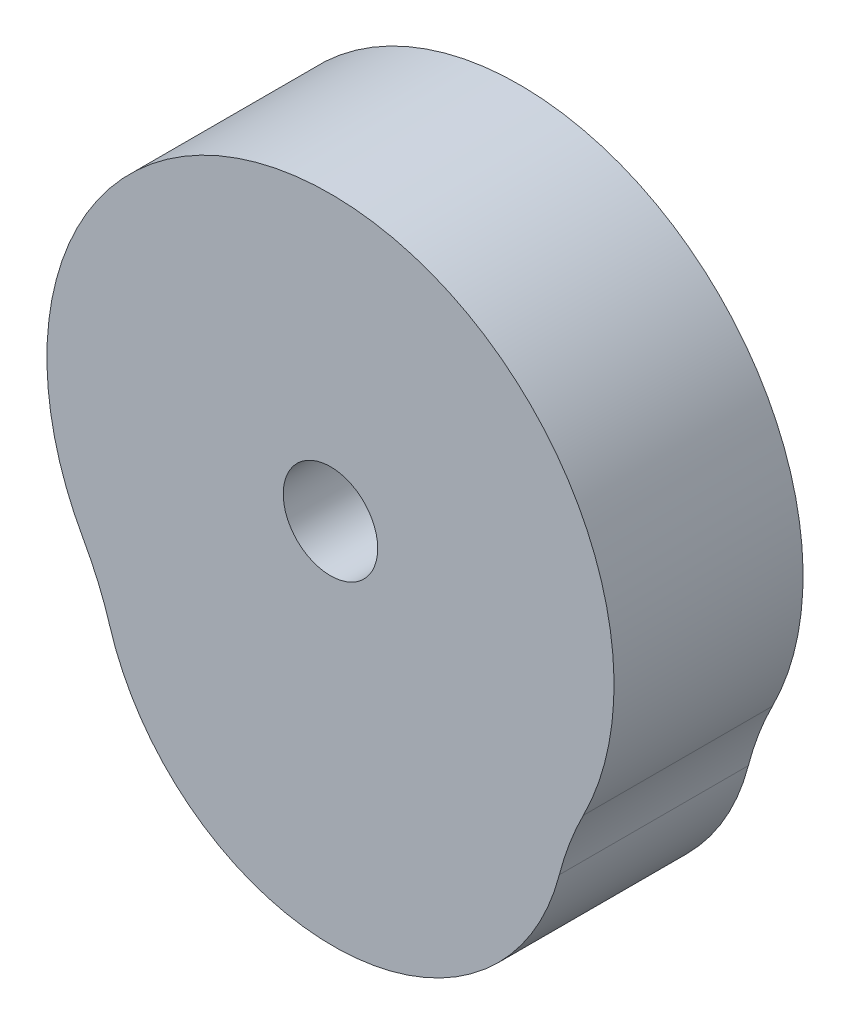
ISO-10303-21;
HEADER;
FILE_DESCRIPTION(('STEP AP214'),'2;1');
FILE_NAME('part.step','',(''),(''),'','','');
FILE_SCHEMA(('AUTOMOTIVE_DESIGN { 1 0 10303 214 1 1 1 1 }'));
ENDSEC;
DATA;
#1=APPLICATION_CONTEXT('core data for automotive mechanical design processes');
#2=APPLICATION_PROTOCOL_DEFINITION('international standard','automotive_design',2000,#1);
#3=PRODUCT_CONTEXT('',#1,'mechanical');
#4=PRODUCT('Part','Part','',(#3));
#5=PRODUCT_RELATED_PRODUCT_CATEGORY('part','',(#4));
#6=PRODUCT_DEFINITION_FORMATION('','',#4);
#7=PRODUCT_DEFINITION_CONTEXT('part definition',#1,'design');
#8=PRODUCT_DEFINITION('design','',#6,#7);
#9=PRODUCT_DEFINITION_SHAPE('','',#8);
#10=(LENGTH_UNIT() NAMED_UNIT(*) SI_UNIT(.MILLI.,.METRE.));
#11=(NAMED_UNIT(*) PLANE_ANGLE_UNIT() SI_UNIT($,.RADIAN.));
#12=(NAMED_UNIT(*) SI_UNIT($,.STERADIAN.) SOLID_ANGLE_UNIT());
#13=UNCERTAINTY_MEASURE_WITH_UNIT(LENGTH_MEASURE(1.E-05),#10,'distance_accuracy_value','');
#14=(GEOMETRIC_REPRESENTATION_CONTEXT(3) GLOBAL_UNCERTAINTY_ASSIGNED_CONTEXT((#13)) GLOBAL_UNIT_ASSIGNED_CONTEXT((#10,
#11,#12)) REPRESENTATION_CONTEXT('',''));
#15=CARTESIAN_POINT('',(0.,0.,0.));
#16=DIRECTION('',(0.,0.,1.));
#17=DIRECTION('',(1.,0.,0.));
#18=AXIS2_PLACEMENT_3D('',#15,#16,#17);
#19=CARTESIAN_POINT('',(16.943243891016,-8.59805131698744,-3.));
#20=DIRECTION('',(0.,0.,1.));
#21=DIRECTION('',(1.,0.,0.));
#22=AXIS2_PLACEMENT_3D('',#19,#20,#21);
#23=CYLINDRICAL_SURFACE('',#22,10.);
#24=DIRECTION('',(0.,0.,1.));
#25=VECTOR('',#24,1.);
#26=CARTESIAN_POINT('',(8.02574710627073,-4.07276115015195,-3.));
#27=LINE('',#26,#25);
#28=CARTESIAN_POINT('',(8.02574710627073,-4.07276115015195,-3.));
#29=VERTEX_POINT('',#28);
#30=CARTESIAN_POINT('',(8.02574710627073,-4.07276115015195,3.));
#31=VERTEX_POINT('',#30);
#32=EDGE_CURVE('E71',#29,#31,#27,.T.);
#33=ORIENTED_EDGE('',*,*,#32,.T.);
#34=CARTESIAN_POINT('',(16.943243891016,-8.59805131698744,3.));
#35=DIRECTION('',(0.,0.,-1.));
#36=DIRECTION('',(-1.,0.,0.));
#37=AXIS2_PLACEMENT_3D('',#34,#35,#36);
#38=CIRCLE('',#37,10.);
#39=CARTESIAN_POINT('',(7.26367335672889,-6.08689336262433,3.));
#40=VERTEX_POINT('',#39);
#41=EDGE_CURVE('E108',#40,#31,#38,.T.);
#42=ORIENTED_EDGE('',*,*,#41,.F.);
#43=DIRECTION('',(0.,0.,1.));
#44=VECTOR('',#43,1.);
#45=CARTESIAN_POINT('',(7.26367335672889,-6.08689336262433,-3.));
#46=LINE('',#45,#44);
#47=CARTESIAN_POINT('',(7.26367335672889,-6.08689336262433,-3.));
#48=VERTEX_POINT('',#47);
#49=EDGE_CURVE('E12',#48,#40,#46,.T.);
#50=ORIENTED_EDGE('',*,*,#49,.F.);
#51=CARTESIAN_POINT('',(16.943243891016,-8.59805131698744,-3.));
#52=DIRECTION('',(0.,0.,-1.));
#53=DIRECTION('',(-1.,0.,0.));
#54=AXIS2_PLACEMENT_3D('',#51,#52,#53);
#55=CIRCLE('',#54,10.);
#56=EDGE_CURVE('E109',#48,#29,#55,.T.);
#57=ORIENTED_EDGE('',*,*,#56,.T.);
#58=EDGE_LOOP('',(#33,#42,#50,#57));
#59=FACE_BOUND('',#58,.T.);
#60=ADVANCED_FACE('F68',(#59),#23,.F.);
#61=CARTESIAN_POINT('',(0.0881870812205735,-4.2253666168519,-3.));
#62=DIRECTION('',(0.,0.,1.));
#63=DIRECTION('',(1.,0.,0.));
#64=AXIS2_PLACEMENT_3D('',#61,#62,#63);
#65=CYLINDRICAL_SURFACE('',#64,7.41302132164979);
#66=ORIENTED_EDGE('',*,*,#49,.T.);
#67=CARTESIAN_POINT('',(0.0881870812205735,-4.2253666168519,3.));
#68=DIRECTION('',(0.,0.,1.));
#69=DIRECTION('',(1.,0.,0.));
#70=AXIS2_PLACEMENT_3D('',#67,#68,#69);
#71=CIRCLE('',#70,7.41302132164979);
#72=CARTESIAN_POINT('',(-7.00338119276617,-6.3846592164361,3.));
#73=VERTEX_POINT('',#72);
#74=EDGE_CURVE('E126',#73,#40,#71,.T.);
#75=ORIENTED_EDGE('',*,*,#74,.F.);
#76=DIRECTION('',(0.,0.,1.));
#77=VECTOR('',#76,1.);
#78=CARTESIAN_POINT('',(-7.00338119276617,-6.3846592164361,-3.));
#79=LINE('',#78,#77);
#80=CARTESIAN_POINT('',(-7.00338119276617,-6.3846592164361,-3.));
#81=VERTEX_POINT('',#80);
#82=EDGE_CURVE('E76',#81,#73,#79,.T.);
#83=ORIENTED_EDGE('',*,*,#82,.F.);
#84=CARTESIAN_POINT('',(0.0881870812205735,-4.2253666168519,-3.));
#85=DIRECTION('',(0.,0.,1.));
#86=DIRECTION('',(1.,0.,0.));
#87=AXIS2_PLACEMENT_3D('',#84,#85,#86);
#88=CIRCLE('',#87,7.41302132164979);
#89=EDGE_CURVE('E113',#81,#48,#88,.T.);
#90=ORIENTED_EDGE('',*,*,#89,.T.);
#91=EDGE_LOOP('',(#66,#75,#83,#90));
#92=FACE_BOUND('',#91,.T.);
#93=ADVANCED_FACE('F147',(#92),#65,.T.);
#94=CARTESIAN_POINT('',(-16.5697482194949,-9.29749664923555,-3.));
#95=DIRECTION('',(0.,0.,1.));
#96=DIRECTION('',(1.,0.,0.));
#97=AXIS2_PLACEMENT_3D('',#94,#95,#96);
#98=CYLINDRICAL_SURFACE('',#97,10.);
#99=ORIENTED_EDGE('',*,*,#82,.T.);
#100=CARTESIAN_POINT('',(-16.5697482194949,-9.29749664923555,3.));
#101=DIRECTION('',(0.,0.,1.));
#102=DIRECTION('',(1.,0.,0.));
#103=AXIS2_PLACEMENT_3D('',#100,#101,#102);
#104=CIRCLE('',#103,10.);
#105=CARTESIAN_POINT('',(-7.84882810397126,-4.4040773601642,3.));
#106=VERTEX_POINT('',#105);
#107=EDGE_CURVE('E121',#73,#106,#104,.T.);
#108=ORIENTED_EDGE('',*,*,#107,.T.);
#109=DIRECTION('',(0.,0.,1.));
#110=VECTOR('',#109,1.);
#111=CARTESIAN_POINT('',(-7.84882810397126,-4.4040773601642,-3.));
#112=LINE('',#111,#110);
#113=CARTESIAN_POINT('',(-7.84882810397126,-4.4040773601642,-3.));
#114=VERTEX_POINT('',#113);
#115=EDGE_CURVE('E112',#114,#106,#112,.T.);
#116=ORIENTED_EDGE('',*,*,#115,.F.);
#117=CARTESIAN_POINT('',(-16.5697482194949,-9.29749664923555,-3.));
#118=DIRECTION('',(0.,0.,1.));
#119=DIRECTION('',(1.,0.,0.));
#120=AXIS2_PLACEMENT_3D('',#117,#118,#119);
#121=CIRCLE('',#120,10.);
#122=EDGE_CURVE('E140',#81,#114,#121,.T.);
#123=ORIENTED_EDGE('',*,*,#122,.F.);
#124=EDGE_LOOP('',(#99,#108,#116,#123));
#125=FACE_BOUND('',#124,.T.);
#126=ADVANCED_FACE('F145',(#125),#98,.F.);
#127=CARTESIAN_POINT('',(0.,0.,-3.));
#128=DIRECTION('',(0.,0.,1.));
#129=DIRECTION('',(1.,0.,0.));
#130=AXIS2_PLACEMENT_3D('',#127,#128,#129);
#131=CYLINDRICAL_SURFACE('',#130,9.);
#132=ORIENTED_EDGE('',*,*,#115,.T.);
#133=CARTESIAN_POINT('',(0.,0.,3.));
#134=DIRECTION('',(0.,0.,1.));
#135=DIRECTION('',(1.,0.,0.));
#136=AXIS2_PLACEMENT_3D('',#133,#134,#135);
#137=CIRCLE('',#136,9.);
#138=EDGE_CURVE('E115',#31,#106,#137,.T.);
#139=ORIENTED_EDGE('',*,*,#138,.F.);
#140=ORIENTED_EDGE('',*,*,#32,.F.);
#141=CARTESIAN_POINT('',(0.,0.,-3.));
#142=DIRECTION('',(0.,0.,1.));
#143=DIRECTION('',(1.,0.,0.));
#144=AXIS2_PLACEMENT_3D('',#141,#142,#143);
#145=CIRCLE('',#144,9.);
#146=EDGE_CURVE('E138',#29,#114,#145,.T.);
#147=ORIENTED_EDGE('',*,*,#146,.T.);
#148=EDGE_LOOP('',(#132,#139,#140,#147));
#149=FACE_BOUND('',#148,.T.);
#150=ADVANCED_FACE('F116',(#149),#131,.T.);
#151=CARTESIAN_POINT('',(8.47162194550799,-4.29902565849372,-3.));
#152=DIRECTION('',(0.,0.,-1.));
#153=DIRECTION('',(-1.,0.,0.));
#154=AXIS2_PLACEMENT_3D('',#151,#152,#153);
#155=PLANE('',#154);
#156=CARTESIAN_POINT('',(0.,0.,-3.));
#157=DIRECTION('',(0.,0.,1.));
#158=DIRECTION('',(1.,0.,0.));
#159=AXIS2_PLACEMENT_3D('',#156,#157,#158);
#160=CIRCLE('',#159,1.5);
#161=CARTESIAN_POINT('',(1.5,0.,-3.));
#162=VERTEX_POINT('',#161);
#163=EDGE_CURVE('E134',#162,#162,#160,.T.);
#164=ORIENTED_EDGE('',*,*,#163,.T.);
#165=EDGE_LOOP('',(#164));
#166=FACE_BOUND('',#165,.T.);
#167=ORIENTED_EDGE('',*,*,#56,.F.);
#168=ORIENTED_EDGE('',*,*,#89,.F.);
#169=ORIENTED_EDGE('',*,*,#122,.T.);
#170=ORIENTED_EDGE('',*,*,#146,.F.);
#171=EDGE_LOOP('',(#167,#168,#169,#170));
#172=FACE_BOUND('',#171,.T.);
#173=ADVANCED_FACE('F149',(#166,#172),#155,.T.);
#174=CARTESIAN_POINT('',(0.,0.,-3.));
#175=DIRECTION('',(0.,0.,1.));
#176=DIRECTION('',(1.,0.,0.));
#177=AXIS2_PLACEMENT_3D('',#174,#175,#176);
#178=CYLINDRICAL_SURFACE('',#177,1.5);
#179=ORIENTED_EDGE('',*,*,#163,.F.);
#180=EDGE_LOOP('',(#179));
#181=FACE_BOUND('',#180,.T.);
#182=CARTESIAN_POINT('',(0.,0.,3.));
#183=DIRECTION('',(0.,0.,1.));
#184=DIRECTION('',(1.,0.,0.));
#185=AXIS2_PLACEMENT_3D('',#182,#183,#184);
#186=CIRCLE('',#185,1.5);
#187=CARTESIAN_POINT('',(1.5,0.,3.));
#188=VERTEX_POINT('',#187);
#189=EDGE_CURVE('E127',#188,#188,#186,.T.);
#190=ORIENTED_EDGE('',*,*,#189,.T.);
#191=EDGE_LOOP('',(#190));
#192=FACE_BOUND('',#191,.T.);
#193=ADVANCED_FACE('F151',(#181,#192),#178,.F.);
#194=CARTESIAN_POINT('',(8.47162194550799,-4.29902565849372,3.));
#195=DIRECTION('',(0.,0.,-1.));
#196=DIRECTION('',(-1.,0.,0.));
#197=AXIS2_PLACEMENT_3D('',#194,#195,#196);
#198=PLANE('',#197);
#199=ORIENTED_EDGE('',*,*,#41,.T.);
#200=ORIENTED_EDGE('',*,*,#138,.T.);
#201=ORIENTED_EDGE('',*,*,#107,.F.);
#202=ORIENTED_EDGE('',*,*,#74,.T.);
#203=EDGE_LOOP('',(#199,#200,#201,#202));
#204=FACE_BOUND('',#203,.T.);
#205=ORIENTED_EDGE('',*,*,#189,.F.);
#206=EDGE_LOOP('',(#205));
#207=FACE_BOUND('',#206,.T.);
#208=ADVANCED_FACE('F124',(#204,#207),#198,.F.);
#209=CLOSED_SHELL('',(#60,#93,#126,#150,#173,#193,#208));
#210=MANIFOLD_SOLID_BREP('B2',#209);
#211=ADVANCED_BREP_SHAPE_REPRESENTATION('',(#18,#210),#14);
#212=SHAPE_DEFINITION_REPRESENTATION(#9,#211);
ENDSEC;
END-ISO-10303-21;
